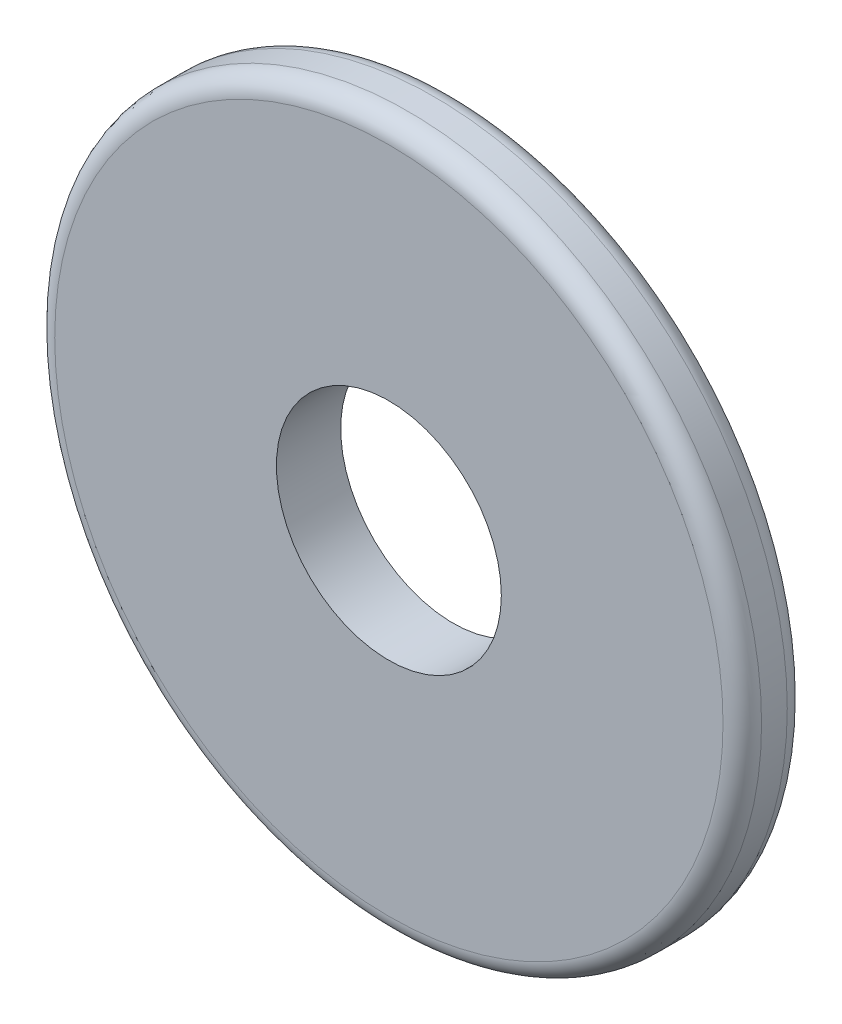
ISO-10303-21;
HEADER;
FILE_DESCRIPTION(('STEP AP214'),'2;1');
FILE_NAME('part.step','',(''),(''),'','','');
FILE_SCHEMA(('AUTOMOTIVE_DESIGN { 1 0 10303 214 1 1 1 1 }'));
ENDSEC;
DATA;
#1=APPLICATION_CONTEXT('core data for automotive mechanical design processes');
#2=APPLICATION_PROTOCOL_DEFINITION('international standard','automotive_design',2000,#1);
#3=PRODUCT_CONTEXT('',#1,'mechanical');
#4=PRODUCT('Part','Part','',(#3));
#5=PRODUCT_RELATED_PRODUCT_CATEGORY('part','',(#4));
#6=PRODUCT_DEFINITION_FORMATION('','',#4);
#7=PRODUCT_DEFINITION_CONTEXT('part definition',#1,'design');
#8=PRODUCT_DEFINITION('design','',#6,#7);
#9=PRODUCT_DEFINITION_SHAPE('','',#8);
#10=(LENGTH_UNIT() NAMED_UNIT(*) SI_UNIT(.MILLI.,.METRE.));
#11=(NAMED_UNIT(*) PLANE_ANGLE_UNIT() SI_UNIT($,.RADIAN.));
#12=(NAMED_UNIT(*) SI_UNIT($,.STERADIAN.) SOLID_ANGLE_UNIT());
#13=UNCERTAINTY_MEASURE_WITH_UNIT(LENGTH_MEASURE(1.E-05),#10,'distance_accuracy_value','');
#14=(GEOMETRIC_REPRESENTATION_CONTEXT(3) GLOBAL_UNCERTAINTY_ASSIGNED_CONTEXT((#13)) GLOBAL_UNIT_ASSIGNED_CONTEXT((#10,
#11,#12)) REPRESENTATION_CONTEXT('',''));
#15=CARTESIAN_POINT('',(0.,0.,0.));
#16=DIRECTION('',(0.,0.,1.));
#17=DIRECTION('',(1.,0.,0.));
#18=AXIS2_PLACEMENT_3D('',#15,#16,#17);
#19=CARTESIAN_POINT('',(0.,0.,1.));
#20=DIRECTION('',(0.,0.,1.));
#21=DIRECTION('',(1.,0.,0.));
#22=AXIS2_PLACEMENT_3D('',#19,#20,#21);
#23=PLANE('',#22);
#24=CARTESIAN_POINT('',(0.,0.,1.));
#25=DIRECTION('',(0.,0.,1.));
#26=DIRECTION('',(1.,0.,0.));
#27=AXIS2_PLACEMENT_3D('',#24,#25,#26);
#28=CIRCLE('',#27,5.2);
#29=CARTESIAN_POINT('',(5.2,0.,1.));
#30=VERTEX_POINT('',#29);
#31=EDGE_CURVE('E10',#30,#30,#28,.T.);
#32=ORIENTED_EDGE('',*,*,#31,.T.);
#33=EDGE_LOOP('',(#32));
#34=FACE_BOUND('',#33,.T.);
#35=CARTESIAN_POINT('',(0.,0.,1.));
#36=DIRECTION('',(0.,0.,1.));
#37=DIRECTION('',(1.,0.,0.));
#38=AXIS2_PLACEMENT_3D('',#35,#36,#37);
#39=CIRCLE('',#38,1.75);
#40=CARTESIAN_POINT('',(1.75,0.,1.));
#41=VERTEX_POINT('',#40);
#42=EDGE_CURVE('E50',#41,#41,#39,.T.);
#43=ORIENTED_EDGE('',*,*,#42,.F.);
#44=EDGE_LOOP('',(#43));
#45=FACE_BOUND('',#44,.T.);
#46=ADVANCED_FACE('F30',(#34,#45),#23,.T.);
#47=CARTESIAN_POINT('',(0.,0.,0.));
#48=DIRECTION('',(0.,0.,1.));
#49=DIRECTION('',(1.,0.,0.));
#50=AXIS2_PLACEMENT_3D('',#47,#48,#49);
#51=PLANE('',#50);
#52=CARTESIAN_POINT('',(0.,0.,0.));
#53=DIRECTION('',(0.,0.,1.));
#54=DIRECTION('',(1.,0.,0.));
#55=AXIS2_PLACEMENT_3D('',#52,#53,#54);
#56=CIRCLE('',#55,5.2);
#57=CARTESIAN_POINT('',(5.2,0.,0.));
#58=VERTEX_POINT('',#57);
#59=EDGE_CURVE('E37',#58,#58,#56,.F.);
#60=ORIENTED_EDGE('',*,*,#59,.T.);
#61=EDGE_LOOP('',(#60));
#62=FACE_BOUND('',#61,.T.);
#63=CARTESIAN_POINT('',(0.,0.,0.));
#64=DIRECTION('',(0.,0.,1.));
#65=DIRECTION('',(1.,0.,0.));
#66=AXIS2_PLACEMENT_3D('',#63,#64,#65);
#67=CIRCLE('',#66,1.75);
#68=CARTESIAN_POINT('',(1.75,0.,0.));
#69=VERTEX_POINT('',#68);
#70=EDGE_CURVE('E53',#69,#69,#67,.T.);
#71=ORIENTED_EDGE('',*,*,#70,.T.);
#72=EDGE_LOOP('',(#71));
#73=FACE_BOUND('',#72,.T.);
#74=ADVANCED_FACE('F57',(#62,#73),#51,.F.);
#75=CARTESIAN_POINT('',(0.,0.,1.));
#76=DIRECTION('',(0.,0.,-1.));
#77=DIRECTION('',(-1.,0.,0.));
#78=AXIS2_PLACEMENT_3D('',#75,#76,#77);
#79=CYLINDRICAL_SURFACE('',#78,5.5);
#80=CARTESIAN_POINT('',(0.,0.,0.3));
#81=DIRECTION('',(0.,0.,1.));
#82=DIRECTION('',(1.,0.,0.));
#83=AXIS2_PLACEMENT_3D('',#80,#81,#82);
#84=CIRCLE('',#83,5.5);
#85=CARTESIAN_POINT('',(5.5,0.,0.3));
#86=VERTEX_POINT('',#85);
#87=EDGE_CURVE('E41',#86,#86,#84,.T.);
#88=ORIENTED_EDGE('',*,*,#87,.T.);
#89=EDGE_LOOP('',(#88));
#90=FACE_BOUND('',#89,.T.);
#91=CARTESIAN_POINT('',(0.,0.,0.7));
#92=DIRECTION('',(0.,0.,1.));
#93=DIRECTION('',(1.,0.,0.));
#94=AXIS2_PLACEMENT_3D('',#91,#92,#93);
#95=CIRCLE('',#94,5.5);
#96=CARTESIAN_POINT('',(5.5,0.,0.7));
#97=VERTEX_POINT('',#96);
#98=EDGE_CURVE('E45',#97,#97,#95,.F.);
#99=ORIENTED_EDGE('',*,*,#98,.T.);
#100=EDGE_LOOP('',(#99));
#101=FACE_BOUND('',#100,.T.);
#102=ADVANCED_FACE('F32',(#90,#101),#79,.T.);
#103=CARTESIAN_POINT('',(0.,0.,1.));
#104=DIRECTION('',(0.,0.,-1.));
#105=DIRECTION('',(-1.,0.,0.));
#106=AXIS2_PLACEMENT_3D('',#103,#104,#105);
#107=CYLINDRICAL_SURFACE('',#106,1.75);
#108=ORIENTED_EDGE('',*,*,#42,.T.);
#109=EDGE_LOOP('',(#108));
#110=FACE_BOUND('',#109,.T.);
#111=ORIENTED_EDGE('',*,*,#70,.F.);
#112=EDGE_LOOP('',(#111));
#113=FACE_BOUND('',#112,.T.);
#114=ADVANCED_FACE('F59',(#110,#113),#107,.F.);
#115=CARTESIAN_POINT('',(0.,0.,0.3));
#116=DIRECTION('',(0.,0.,1.));
#117=DIRECTION('',(1.,0.,0.));
#118=AXIS2_PLACEMENT_3D('',#115,#116,#117);
#119=TOROIDAL_SURFACE('',#118,5.2,0.3);
#120=ORIENTED_EDGE('',*,*,#59,.F.);
#121=EDGE_LOOP('',(#120));
#122=FACE_BOUND('',#121,.T.);
#123=ORIENTED_EDGE('',*,*,#87,.F.);
#124=EDGE_LOOP('',(#123));
#125=FACE_BOUND('',#124,.T.);
#126=ADVANCED_FACE('F61',(#122,#125),#119,.T.);
#127=CARTESIAN_POINT('',(0.,0.,0.7));
#128=DIRECTION('',(0.,0.,1.));
#129=DIRECTION('',(1.,0.,0.));
#130=AXIS2_PLACEMENT_3D('',#127,#128,#129);
#131=TOROIDAL_SURFACE('',#130,5.2,0.3);
#132=ORIENTED_EDGE('',*,*,#98,.F.);
#133=EDGE_LOOP('',(#132));
#134=FACE_BOUND('',#133,.T.);
#135=ORIENTED_EDGE('',*,*,#31,.F.);
#136=EDGE_LOOP('',(#135));
#137=FACE_BOUND('',#136,.T.);
#138=ADVANCED_FACE('F68',(#134,#137),#131,.T.);
#139=CLOSED_SHELL('',(#46,#74,#102,#114,#126,#138));
#140=MANIFOLD_SOLID_BREP('B2',#139);
#141=ADVANCED_BREP_SHAPE_REPRESENTATION('',(#18,#140),#14);
#142=SHAPE_DEFINITION_REPRESENTATION(#9,#141);
ENDSEC;
END-ISO-10303-21;
